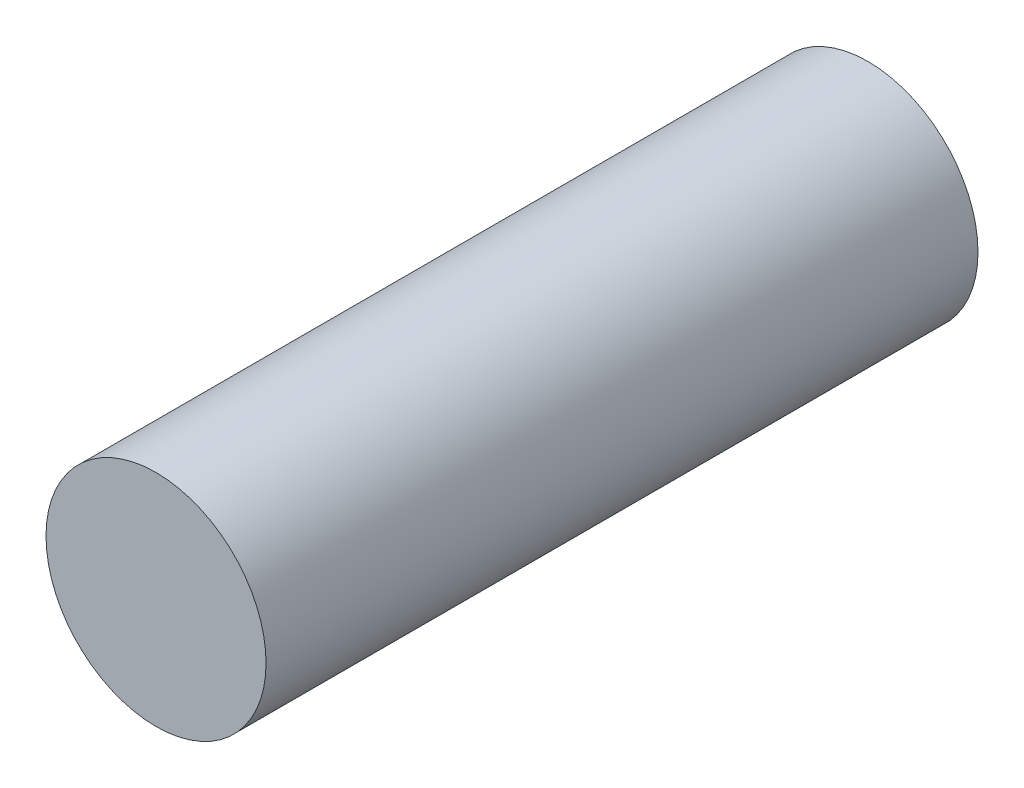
from build123d import *

# Parameters (mm, degrees)
SKETCH1_R           = 0.6477
BOSS_EXTRUDE1_DEPTH = 4.191


with BuildPart() as part:
    # Sketch1 → Boss-Extrude1 (new body)
    with BuildSketch(Plane.XY):
        Circle(SKETCH1_R)
    extrude(amount=BOSS_EXTRUDE1_DEPTH)


solid = part.part
